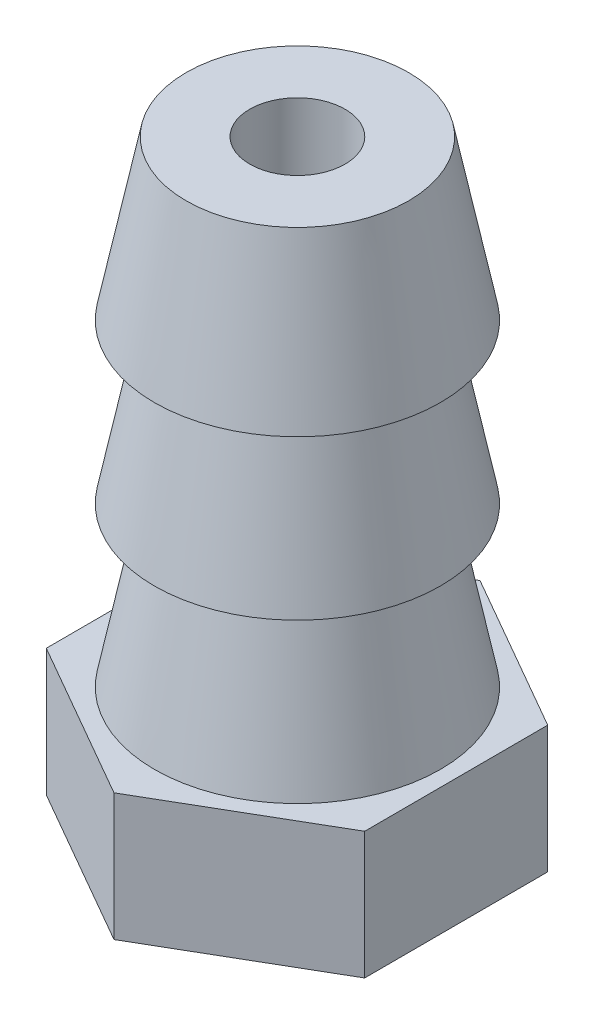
from build123d import *

# Parameters (mm, degrees)
BOSS_EXTRU_1_DEPTH      = 2
ESQUISSE3_R             = 0.75
ENL_V_MAT_EXTRU_1_DEPTH = 11.239593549


with BuildPart() as part:
    # Esquisse1 → Boss.-Extru.1 (new body)
    with BuildSketch(Plane(origin=(0, 0, 0), x_dir=(1, 0, 0), z_dir=(0, 1, 0))):
        Polygon((-2.496793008, -1.44891615), (0.00640169, -2.886744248), (2.503194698, -1.437828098), (2.496793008, 1.44891615), (-0.00640169, 2.886744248), (-2.503194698, 1.437828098), align=None)
    extrude(amount=BOSS_EXTRU_1_DEPTH)

    # Esquisse2 → R_volution1 (revolve)
    with BuildSketch(Plane.XY, mode=Mode.PRIVATE) as r_volution1_sk:
        Polygon((0.00640169, 2), (-2.24359831, 2), (-1.74359831, 4.5), (-2.24359831, 4.5), (-1.74359831, 7), (-2.24359831, 7), (-1.74359831, 9.5), (0.00640169, 9.5), align=None)
    revolve(r_volution1_sk.sketch.rotate(Axis((0.00640169, 2, 0), (0, 1, 0)), 270), axis=Axis((0.00640169, 2, 0), (0, 1, 0)))

    # Esquisse3 → Enl_v. mat.-Extru.1 (cut, through all)
    with BuildSketch(Plane(origin=(0, 9.5, 0), x_dir=(1, 0, 0), z_dir=(0, 1, 0))):
        with Locations(Location((0.00640169, 0, 0), (0, 0, 270))):
            Circle(ESQUISSE3_R)
    extrude(amount=-ENL_V_MAT_EXTRU_1_DEPTH, mode=Mode.SUBTRACT)


solid = part.part
